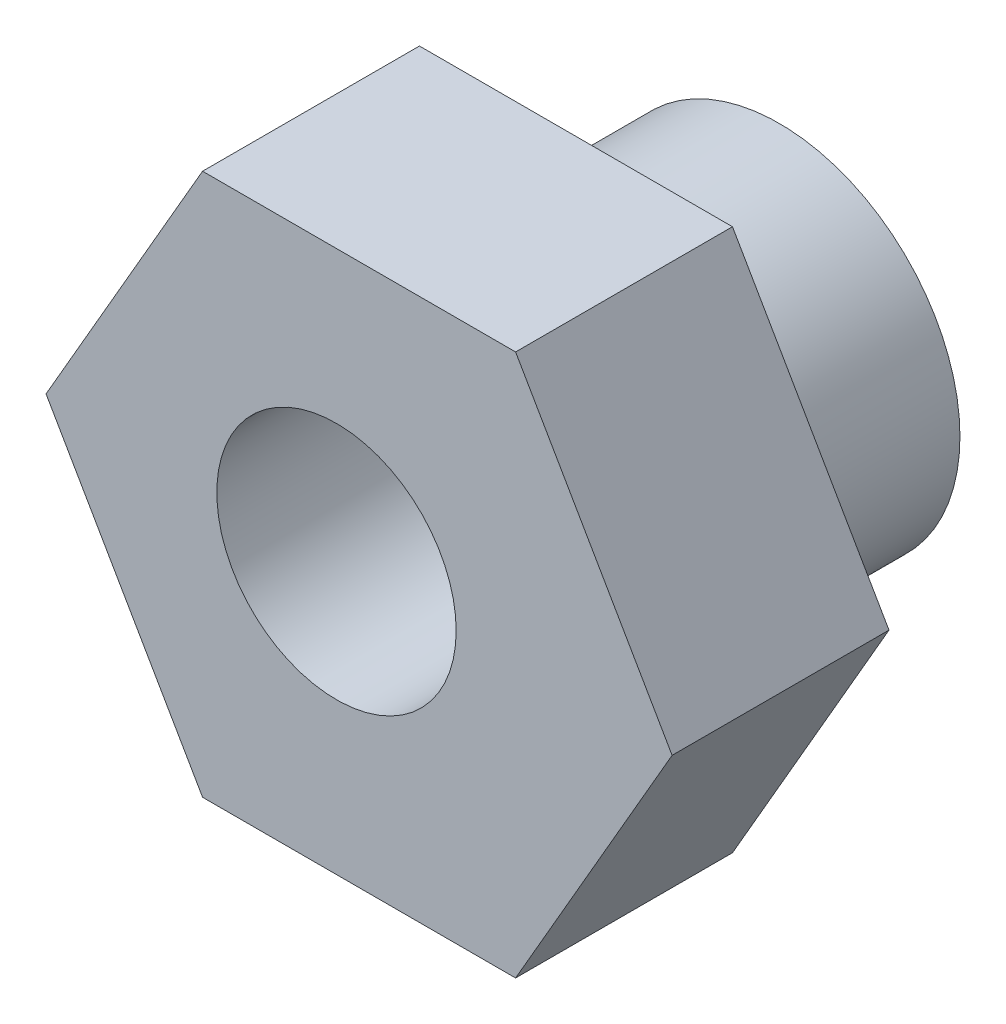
ISO-10303-21;
HEADER;
FILE_DESCRIPTION(('STEP AP214'),'2;1');
FILE_NAME('part.step','',(''),(''),'','','');
FILE_SCHEMA(('AUTOMOTIVE_DESIGN { 1 0 10303 214 1 1 1 1 }'));
ENDSEC;
DATA;
#1=APPLICATION_CONTEXT('core data for automotive mechanical design processes');
#2=APPLICATION_PROTOCOL_DEFINITION('international standard','automotive_design',2000,#1);
#3=PRODUCT_CONTEXT('',#1,'mechanical');
#4=PRODUCT('Part','Part','',(#3));
#5=PRODUCT_RELATED_PRODUCT_CATEGORY('part','',(#4));
#6=PRODUCT_DEFINITION_FORMATION('','',#4);
#7=PRODUCT_DEFINITION_CONTEXT('part definition',#1,'design');
#8=PRODUCT_DEFINITION('design','',#6,#7);
#9=PRODUCT_DEFINITION_SHAPE('','',#8);
#10=(LENGTH_UNIT() NAMED_UNIT(*) SI_UNIT(.MILLI.,.METRE.));
#11=(NAMED_UNIT(*) PLANE_ANGLE_UNIT() SI_UNIT($,.RADIAN.));
#12=(NAMED_UNIT(*) SI_UNIT($,.STERADIAN.) SOLID_ANGLE_UNIT());
#13=UNCERTAINTY_MEASURE_WITH_UNIT(LENGTH_MEASURE(1.E-05),#10,'distance_accuracy_value','');
#14=(GEOMETRIC_REPRESENTATION_CONTEXT(3) GLOBAL_UNCERTAINTY_ASSIGNED_CONTEXT((#13)) GLOBAL_UNIT_ASSIGNED_CONTEXT((#10,
#11,#12)) REPRESENTATION_CONTEXT('',''));
#15=CARTESIAN_POINT('',(0.,0.,0.));
#16=DIRECTION('',(0.,0.,1.));
#17=DIRECTION('',(1.,0.,0.));
#18=AXIS2_PLACEMENT_3D('',#15,#16,#17);
#19=CARTESIAN_POINT('',(-5.19615234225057,-3.00000000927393,2.40000011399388));
#20=DIRECTION('',(-0.866025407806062,-0.499999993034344,0.));
#21=DIRECTION('',(0.499999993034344,-0.866025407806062,0.));
#22=AXIS2_PLACEMENT_3D('',#19,#20,#21);
#23=PLANE('',#22);
#24=DIRECTION('',(0.,0.,1.));
#25=VECTOR('',#24,1.);
#26=CARTESIAN_POINT('',(-6.92820312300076,0.,2.40000011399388));
#27=LINE('',#26,#25);
#28=CARTESIAN_POINT('',(-6.92820312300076,0.,0.));
#29=VERTEX_POINT('',#28);
#30=CARTESIAN_POINT('',(-6.92820312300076,0.,4.80000022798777));
#31=VERTEX_POINT('',#30);
#32=EDGE_CURVE('E156',#29,#31,#27,.T.);
#33=ORIENTED_EDGE('',*,*,#32,.F.);
#34=DIRECTION('',(-0.499999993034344,0.866025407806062,0.));
#35=VECTOR('',#34,1.);
#36=CARTESIAN_POINT('',(-5.19615234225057,-3.00000000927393,0.));
#37=LINE('',#36,#35);
#38=CARTESIAN_POINT('',(-3.46410154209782,-6.00000005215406,0.));
#39=VERTEX_POINT('',#38);
#40=EDGE_CURVE('E128',#29,#39,#37,.F.);
#41=ORIENTED_EDGE('',*,*,#40,.T.);
#42=DIRECTION('',(0.,0.,-1.));
#43=VECTOR('',#42,1.);
#44=CARTESIAN_POINT('',(-3.46410154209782,-6.00000005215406,2.40000011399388));
#45=LINE('',#44,#43);
#46=CARTESIAN_POINT('',(-3.46410154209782,-6.00000005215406,4.80000022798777));
#47=VERTEX_POINT('',#46);
#48=EDGE_CURVE('E118',#39,#47,#45,.F.);
#49=ORIENTED_EDGE('',*,*,#48,.T.);
#50=DIRECTION('',(0.499999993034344,-0.866025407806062,0.));
#51=VECTOR('',#50,1.);
#52=CARTESIAN_POINT('',(-5.19615239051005,-2.99999992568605,4.80000022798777));
#53=LINE('',#52,#51);
#54=EDGE_CURVE('E126',#31,#47,#53,.T.);
#55=ORIENTED_EDGE('',*,*,#54,.F.);
#56=EDGE_LOOP('',(#33,#41,#49,#55));
#57=FACE_BOUND('',#56,.T.);
#58=ADVANCED_FACE('F58',(#57),#23,.T.);
#59=CARTESIAN_POINT('',(0.,6.00000005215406,2.40000011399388));
#60=DIRECTION('',(0.,-1.,0.));
#61=DIRECTION('',(0.,0.,-1.));
#62=AXIS2_PLACEMENT_3D('',#59,#60,#61);
#63=PLANE('',#62);
#64=DIRECTION('',(1.,0.,0.));
#65=VECTOR('',#64,1.);
#66=CARTESIAN_POINT('',(0.,6.00000005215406,4.80000022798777));
#67=LINE('',#66,#65);
#68=CARTESIAN_POINT('',(3.46410154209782,6.00000005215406,4.80000022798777));
#69=VERTEX_POINT('',#68);
#70=CARTESIAN_POINT('',(-3.46410154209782,6.00000005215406,4.80000022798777));
#71=VERTEX_POINT('',#70);
#72=EDGE_CURVE('E139',#69,#71,#67,.F.);
#73=ORIENTED_EDGE('',*,*,#72,.F.);
#74=DIRECTION('',(0.,0.,-1.));
#75=VECTOR('',#74,1.);
#76=CARTESIAN_POINT('',(3.46410154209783,6.00000005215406,2.40000011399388));
#77=LINE('',#76,#75);
#78=CARTESIAN_POINT('',(3.46410154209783,6.00000005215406,0.));
#79=VERTEX_POINT('',#78);
#80=EDGE_CURVE('E165',#79,#69,#77,.F.);
#81=ORIENTED_EDGE('',*,*,#80,.F.);
#82=DIRECTION('',(-1.,0.,0.));
#83=VECTOR('',#82,1.);
#84=CARTESIAN_POINT('',(0.,6.00000005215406,0.));
#85=LINE('',#84,#83);
#86=CARTESIAN_POINT('',(-3.46410154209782,6.00000005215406,0.));
#87=VERTEX_POINT('',#86);
#88=EDGE_CURVE('E155',#79,#87,#85,.T.);
#89=ORIENTED_EDGE('',*,*,#88,.T.);
#90=DIRECTION('',(0.,0.,-1.));
#91=VECTOR('',#90,1.);
#92=CARTESIAN_POINT('',(-3.46410154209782,6.00000005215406,2.40000011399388));
#93=LINE('',#92,#91);
#94=EDGE_CURVE('E146',#87,#71,#93,.F.);
#95=ORIENTED_EDGE('',*,*,#94,.T.);
#96=EDGE_LOOP('',(#73,#81,#89,#95));
#97=FACE_BOUND('',#96,.T.);
#98=ADVANCED_FACE('F236',(#97),#63,.F.);
#99=CARTESIAN_POINT('',(0.,0.,-4.4999998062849));
#100=DIRECTION('',(0.,0.,1.));
#101=DIRECTION('',(1.,0.,0.));
#102=AXIS2_PLACEMENT_3D('',#99,#100,#101);
#103=PLANE('',#102);
#104=CARTESIAN_POINT('',(-0.500000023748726,0.,-4.4999998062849));
#105=DIRECTION('',(0.,0.,1.));
#106=DIRECTION('',(1.,0.,0.));
#107=AXIS2_PLACEMENT_3D('',#104,#105,#106);
#108=CIRCLE('',#107,2.64893639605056);
#109=CARTESIAN_POINT('',(2.14893637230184,0.,-4.4999998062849));
#110=VERTEX_POINT('',#109);
#111=EDGE_CURVE('E69',#110,#110,#108,.F.);
#112=ORIENTED_EDGE('',*,*,#111,.F.);
#113=EDGE_LOOP('',(#112));
#114=FACE_BOUND('',#113,.T.);
#115=CARTESIAN_POINT('',(0.,0.,-4.4999998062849));
#116=DIRECTION('',(0.,0.,1.));
#117=DIRECTION('',(1.,0.,0.));
#118=AXIS2_PLACEMENT_3D('',#115,#116,#117);
#119=CIRCLE('',#118,3.99891894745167);
#120=CARTESIAN_POINT('',(3.99891894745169,0.,-4.4999998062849));
#121=VERTEX_POINT('',#120);
#122=EDGE_CURVE('E12',#121,#121,#119,.F.);
#123=ORIENTED_EDGE('',*,*,#122,.T.);
#124=EDGE_LOOP('',(#123));
#125=FACE_BOUND('',#124,.T.);
#126=ADVANCED_FACE('F233',(#114,#125),#103,.F.);
#127=CARTESIAN_POINT('',(-0.500000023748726,0.,-4.4999998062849));
#128=DIRECTION('',(-7.80241268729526E-13,0.,1.));
#129=DIRECTION('',(1.,0.,7.80241268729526E-13));
#130=AXIS2_PLACEMENT_3D('',#127,#128,#129);
#131=CYLINDRICAL_SURFACE('',#130,2.64893639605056);
#132=CARTESIAN_POINT('',(-0.500000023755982,0.,4.80000022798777));
#133=DIRECTION('',(0.,0.,1.));
#134=DIRECTION('',(1.,0.,0.));
#135=AXIS2_PLACEMENT_3D('',#132,#133,#134);
#136=CIRCLE('',#135,2.64893639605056);
#137=CARTESIAN_POINT('',(2.14893637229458,0.,4.80000022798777));
#138=VERTEX_POINT('',#137);
#139=EDGE_CURVE('E143',#138,#138,#136,.F.);
#140=ORIENTED_EDGE('',*,*,#139,.F.);
#141=EDGE_LOOP('',(#140));
#142=FACE_BOUND('',#141,.T.);
#143=ORIENTED_EDGE('',*,*,#111,.T.);
#144=EDGE_LOOP('',(#143));
#145=FACE_BOUND('',#144,.T.);
#146=ADVANCED_FACE('F231',(#142,#145),#131,.F.);
#147=CARTESIAN_POINT('',(0.,0.,0.));
#148=DIRECTION('',(0.,0.,-1.));
#149=DIRECTION('',(0.,1.,0.));
#150=AXIS2_PLACEMENT_3D('',#147,#148,#149);
#151=CYLINDRICAL_SURFACE('',#150,3.99891894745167);
#152=ORIENTED_EDGE('',*,*,#122,.F.);
#153=EDGE_LOOP('',(#152));
#154=FACE_BOUND('',#153,.T.);
#155=CARTESIAN_POINT('',(0.,0.,0.));
#156=DIRECTION('',(0.,0.,1.));
#157=DIRECTION('',(1.,0.,0.));
#158=AXIS2_PLACEMENT_3D('',#155,#156,#157);
#159=CIRCLE('',#158,3.99891894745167);
#160=CARTESIAN_POINT('',(3.99891894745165,0.,0.));
#161=VERTEX_POINT('',#160);
#162=EDGE_CURVE('E172',#161,#161,#159,.F.);
#163=ORIENTED_EDGE('',*,*,#162,.T.);
#164=EDGE_LOOP('',(#163));
#165=FACE_BOUND('',#164,.T.);
#166=ADVANCED_FACE('F240',(#154,#165),#151,.T.);
#167=CARTESIAN_POINT('',(0.,0.,4.80000022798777));
#168=DIRECTION('',(0.,0.,1.));
#169=DIRECTION('',(1.,0.,0.));
#170=AXIS2_PLACEMENT_3D('',#167,#168,#169);
#171=PLANE('',#170);
#172=DIRECTION('',(-0.499999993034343,-0.866025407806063,0.));
#173=VECTOR('',#172,1.);
#174=CARTESIAN_POINT('',(5.19615234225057,-3.00000000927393,4.80000022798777));
#175=LINE('',#174,#173);
#176=CARTESIAN_POINT('',(6.92820312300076,0.,4.80000022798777));
#177=VERTEX_POINT('',#176);
#178=CARTESIAN_POINT('',(3.46410154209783,-6.00000005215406,4.80000022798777));
#179=VERTEX_POINT('',#178);
#180=EDGE_CURVE('E77',#177,#179,#175,.T.);
#181=ORIENTED_EDGE('',*,*,#180,.F.);
#182=DIRECTION('',(0.499999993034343,-0.866025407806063,0.));
#183=VECTOR('',#182,1.);
#184=CARTESIAN_POINT('',(5.19615234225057,3.00000000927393,4.80000022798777));
#185=LINE('',#184,#183);
#186=EDGE_CURVE('E160',#69,#177,#185,.T.);
#187=ORIENTED_EDGE('',*,*,#186,.F.);
#188=ORIENTED_EDGE('',*,*,#72,.T.);
#189=DIRECTION('',(-0.499999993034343,-0.866025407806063,0.));
#190=VECTOR('',#189,1.);
#191=CARTESIAN_POINT('',(-5.19615239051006,2.99999992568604,4.80000022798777));
#192=LINE('',#191,#190);
#193=EDGE_CURVE('E134',#71,#31,#192,.T.);
#194=ORIENTED_EDGE('',*,*,#193,.T.);
#195=ORIENTED_EDGE('',*,*,#54,.T.);
#196=DIRECTION('',(1.,0.,0.));
#197=VECTOR('',#196,1.);
#198=CARTESIAN_POINT('',(0.,-6.00000005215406,4.80000022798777));
#199=LINE('',#198,#197);
#200=EDGE_CURVE('E115',#179,#47,#199,.F.);
#201=ORIENTED_EDGE('',*,*,#200,.F.);
#202=EDGE_LOOP('',(#181,#187,#188,#194,#195,#201));
#203=FACE_BOUND('',#202,.T.);
#204=ORIENTED_EDGE('',*,*,#139,.T.);
#205=EDGE_LOOP('',(#204));
#206=FACE_BOUND('',#205,.T.);
#207=ADVANCED_FACE('F131',(#203,#206),#171,.T.);
#208=CARTESIAN_POINT('',(5.19615234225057,-3.00000000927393,2.40000011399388));
#209=DIRECTION('',(0.866025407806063,-0.499999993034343,0.));
#210=DIRECTION('',(0.499999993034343,0.866025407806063,0.));
#211=AXIS2_PLACEMENT_3D('',#208,#209,#210);
#212=PLANE('',#211);
#213=DIRECTION('',(0.,0.,-1.));
#214=VECTOR('',#213,1.);
#215=CARTESIAN_POINT('',(3.46410154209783,-6.00000005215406,2.40000011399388));
#216=LINE('',#215,#214);
#217=CARTESIAN_POINT('',(3.46410154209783,-6.00000005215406,0.));
#218=VERTEX_POINT('',#217);
#219=EDGE_CURVE('E119',#218,#179,#216,.F.);
#220=ORIENTED_EDGE('',*,*,#219,.F.);
#221=DIRECTION('',(-0.499999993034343,-0.866025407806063,0.));
#222=VECTOR('',#221,1.);
#223=CARTESIAN_POINT('',(5.19615234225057,-3.00000000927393,0.));
#224=LINE('',#223,#222);
#225=CARTESIAN_POINT('',(6.92820312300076,0.,0.));
#226=VERTEX_POINT('',#225);
#227=EDGE_CURVE('E148',#218,#226,#224,.F.);
#228=ORIENTED_EDGE('',*,*,#227,.T.);
#229=DIRECTION('',(0.,0.,1.));
#230=VECTOR('',#229,1.);
#231=CARTESIAN_POINT('',(6.92820312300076,0.,2.40000011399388));
#232=LINE('',#231,#230);
#233=EDGE_CURVE('E164',#226,#177,#232,.T.);
#234=ORIENTED_EDGE('',*,*,#233,.T.);
#235=ORIENTED_EDGE('',*,*,#180,.T.);
#236=EDGE_LOOP('',(#220,#228,#234,#235));
#237=FACE_BOUND('',#236,.T.);
#238=ADVANCED_FACE('F250',(#237),#212,.T.);
#239=CARTESIAN_POINT('',(0.,-6.00000005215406,2.40000011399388));
#240=DIRECTION('',(0.,1.,0.));
#241=DIRECTION('',(0.,0.,1.));
#242=AXIS2_PLACEMENT_3D('',#239,#240,#241);
#243=PLANE('',#242);
#244=ORIENTED_EDGE('',*,*,#219,.T.);
#245=ORIENTED_EDGE('',*,*,#200,.T.);
#246=ORIENTED_EDGE('',*,*,#48,.F.);
#247=DIRECTION('',(1.,0.,0.));
#248=VECTOR('',#247,1.);
#249=CARTESIAN_POINT('',(0.,-6.00000005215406,0.));
#250=LINE('',#249,#248);
#251=EDGE_CURVE('E62',#39,#218,#250,.T.);
#252=ORIENTED_EDGE('',*,*,#251,.T.);
#253=EDGE_LOOP('',(#244,#245,#246,#252));
#254=FACE_BOUND('',#253,.T.);
#255=ADVANCED_FACE('F117',(#254),#243,.F.);
#256=CARTESIAN_POINT('',(-5.19615234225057,3.00000000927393,2.40000011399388));
#257=DIRECTION('',(-0.866025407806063,0.499999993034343,0.));
#258=DIRECTION('',(-0.499999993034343,-0.866025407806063,0.));
#259=AXIS2_PLACEMENT_3D('',#256,#257,#258);
#260=PLANE('',#259);
#261=DIRECTION('',(0.499999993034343,0.866025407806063,0.));
#262=VECTOR('',#261,1.);
#263=CARTESIAN_POINT('',(-5.19615234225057,3.00000000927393,0.));
#264=LINE('',#263,#262);
#265=EDGE_CURVE('E159',#87,#29,#264,.F.);
#266=ORIENTED_EDGE('',*,*,#265,.T.);
#267=ORIENTED_EDGE('',*,*,#32,.T.);
#268=ORIENTED_EDGE('',*,*,#193,.F.);
#269=ORIENTED_EDGE('',*,*,#94,.F.);
#270=EDGE_LOOP('',(#266,#267,#268,#269));
#271=FACE_BOUND('',#270,.T.);
#272=ADVANCED_FACE('F257',(#271),#260,.T.);
#273=CARTESIAN_POINT('',(5.19615234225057,3.00000000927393,2.40000011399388));
#274=DIRECTION('',(0.866025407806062,0.499999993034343,0.));
#275=DIRECTION('',(-0.499999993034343,0.866025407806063,0.));
#276=AXIS2_PLACEMENT_3D('',#273,#274,#275);
#277=PLANE('',#276);
#278=ORIENTED_EDGE('',*,*,#233,.F.);
#279=DIRECTION('',(0.499999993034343,-0.866025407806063,0.));
#280=VECTOR('',#279,1.);
#281=CARTESIAN_POINT('',(5.19615234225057,3.00000000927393,0.));
#282=LINE('',#281,#280);
#283=EDGE_CURVE('E168',#226,#79,#282,.F.);
#284=ORIENTED_EDGE('',*,*,#283,.T.);
#285=ORIENTED_EDGE('',*,*,#80,.T.);
#286=ORIENTED_EDGE('',*,*,#186,.T.);
#287=EDGE_LOOP('',(#278,#284,#285,#286));
#288=FACE_BOUND('',#287,.T.);
#289=ADVANCED_FACE('F247',(#288),#277,.T.);
#290=CARTESIAN_POINT('',(0.,0.,0.));
#291=DIRECTION('',(0.,0.,1.));
#292=DIRECTION('',(1.,0.,0.));
#293=AXIS2_PLACEMENT_3D('',#290,#291,#292);
#294=PLANE('',#293);
#295=ORIENTED_EDGE('',*,*,#162,.F.);
#296=EDGE_LOOP('',(#295));
#297=FACE_BOUND('',#296,.T.);
#298=ORIENTED_EDGE('',*,*,#227,.F.);
#299=ORIENTED_EDGE('',*,*,#251,.F.);
#300=ORIENTED_EDGE('',*,*,#40,.F.);
#301=ORIENTED_EDGE('',*,*,#265,.F.);
#302=ORIENTED_EDGE('',*,*,#88,.F.);
#303=ORIENTED_EDGE('',*,*,#283,.F.);
#304=EDGE_LOOP('',(#298,#299,#300,#301,#302,#303));
#305=FACE_BOUND('',#304,.T.);
#306=ADVANCED_FACE('F60',(#297,#305),#294,.F.);
#307=CLOSED_SHELL('',(#58,#98,#126,#146,#166,#207,#238,#255,#272,#289,#306));
#308=MANIFOLD_SOLID_BREP('B2',#307);
#309=ADVANCED_BREP_SHAPE_REPRESENTATION('',(#18,#308),#14);
#310=SHAPE_DEFINITION_REPRESENTATION(#9,#309);
ENDSEC;
END-ISO-10303-21;
